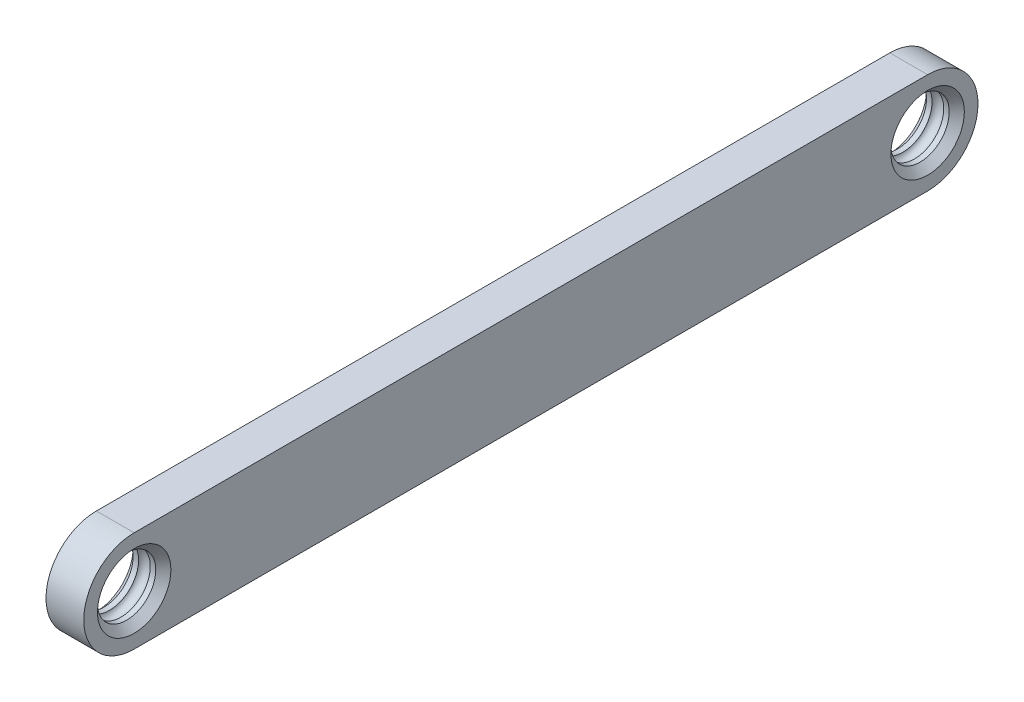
ISO-10303-21;
HEADER;
FILE_DESCRIPTION(('STEP AP214'),'2;1');
FILE_NAME('part.step','',(''),(''),'','','');
FILE_SCHEMA(('AUTOMOTIVE_DESIGN { 1 0 10303 214 1 1 1 1 }'));
ENDSEC;
DATA;
#1=APPLICATION_CONTEXT('core data for automotive mechanical design processes');
#2=APPLICATION_PROTOCOL_DEFINITION('international standard','automotive_design',2000,#1);
#3=PRODUCT_CONTEXT('',#1,'mechanical');
#4=PRODUCT('Part','Part','',(#3));
#5=PRODUCT_RELATED_PRODUCT_CATEGORY('part','',(#4));
#6=PRODUCT_DEFINITION_FORMATION('','',#4);
#7=PRODUCT_DEFINITION_CONTEXT('part definition',#1,'design');
#8=PRODUCT_DEFINITION('design','',#6,#7);
#9=PRODUCT_DEFINITION_SHAPE('','',#8);
#10=(LENGTH_UNIT() NAMED_UNIT(*) SI_UNIT(.MILLI.,.METRE.));
#11=(NAMED_UNIT(*) PLANE_ANGLE_UNIT() SI_UNIT($,.RADIAN.));
#12=(NAMED_UNIT(*) SI_UNIT($,.STERADIAN.) SOLID_ANGLE_UNIT());
#13=UNCERTAINTY_MEASURE_WITH_UNIT(LENGTH_MEASURE(1.E-05),#10,'distance_accuracy_value','');
#14=(GEOMETRIC_REPRESENTATION_CONTEXT(3) GLOBAL_UNCERTAINTY_ASSIGNED_CONTEXT((#13)) GLOBAL_UNIT_ASSIGNED_CONTEXT((#10,
#11,#12)) REPRESENTATION_CONTEXT('',''));
#15=CARTESIAN_POINT('',(0.,0.,0.));
#16=DIRECTION('',(0.,0.,1.));
#17=DIRECTION('',(1.,0.,0.));
#18=AXIS2_PLACEMENT_3D('',#15,#16,#17);
#19=CARTESIAN_POINT('',(4.7625,0.,-99.9999998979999));
#20=DIRECTION('',(-1.,0.,0.));
#21=DIRECTION('',(0.,0.,1.));
#22=AXIS2_PLACEMENT_3D('',#19,#20,#21);
#23=CYLINDRICAL_SURFACE('',#22,3.67499999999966);
#24=CARTESIAN_POINT('',(1.64637649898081,0.,-99.9999998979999));
#25=DIRECTION('',(1.,0.,0.));
#26=DIRECTION('',(0.,0.,-1.));
#27=AXIS2_PLACEMENT_3D('',#24,#25,#26);
#28=CIRCLE('',#27,3.67499999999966);
#29=CARTESIAN_POINT('',(1.64637649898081,0.,-96.3249998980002));
#30=VERTEX_POINT('',#29);
#31=EDGE_CURVE('E48',#30,#30,#28,.F.);
#32=CARTESIAN_POINT('',(0.952499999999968,0.,-99.9999998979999));
#33=DIRECTION('',(1.,0.,0.));
#34=DIRECTION('',(0.,0.,-1.));
#35=AXIS2_PLACEMENT_3D('',#32,#33,#34);
#36=CIRCLE('',#35,3.67499999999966);
#37=CARTESIAN_POINT('',(0.952499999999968,0.,-96.3249998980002));
#38=VERTEX_POINT('',#37);
#39=EDGE_CURVE('E11',#38,#38,#36,.F.);
#40=CARTESIAN_POINT('',(1.64637649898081,0.,-96.3249998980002));
#41=CARTESIAN_POINT('',(1.63914861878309,0.,-96.3249998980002));
#42=CARTESIAN_POINT('',(1.63192073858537,0.,-96.3249998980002));
#43=CARTESIAN_POINT('',(1.61746497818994,0.,-96.3249998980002));
#44=CARTESIAN_POINT('',(1.61023709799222,0.,-96.3249998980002));
#45=CARTESIAN_POINT('',(1.59578133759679,0.,-96.3249998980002));
#46=CARTESIAN_POINT('',(1.58855345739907,0.,-96.3249998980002));
#47=CARTESIAN_POINT('',(1.57409769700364,0.,-96.3249998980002));
#48=CARTESIAN_POINT('',(1.56686981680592,0.,-96.3249998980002));
#49=CARTESIAN_POINT('',(1.55241405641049,0.,-96.3249998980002));
#50=CARTESIAN_POINT('',(1.54518617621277,0.,-96.3249998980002));
#51=CARTESIAN_POINT('',(1.53073041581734,0.,-96.3249998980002));
#52=CARTESIAN_POINT('',(1.52350253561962,0.,-96.3249998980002));
#53=CARTESIAN_POINT('',(1.50904677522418,0.,-96.3249998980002));
#54=CARTESIAN_POINT('',(1.50181889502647,0.,-96.3249998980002));
#55=CARTESIAN_POINT('',(1.48736313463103,0.,-96.3249998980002));
#56=CARTESIAN_POINT('',(1.48013525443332,0.,-96.3249998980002));
#57=CARTESIAN_POINT('',(1.46567949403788,0.,-96.3249998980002));
#58=CARTESIAN_POINT('',(1.45845161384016,0.,-96.3249998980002));
#59=CARTESIAN_POINT('',(1.44399585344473,0.,-96.3249998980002));
#60=CARTESIAN_POINT('',(1.43676797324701,0.,-96.3249998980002));
#61=CARTESIAN_POINT('',(1.42231221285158,0.,-96.3249998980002));
#62=CARTESIAN_POINT('',(1.41508433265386,0.,-96.3249998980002));
#63=CARTESIAN_POINT('',(1.40062857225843,0.,-96.3249998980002));
#64=CARTESIAN_POINT('',(1.39340069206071,0.,-96.3249998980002));
#65=CARTESIAN_POINT('',(1.37894493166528,0.,-96.3249998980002));
#66=CARTESIAN_POINT('',(1.37171705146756,0.,-96.3249998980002));
#67=CARTESIAN_POINT('',(1.35726129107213,0.,-96.3249998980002));
#68=CARTESIAN_POINT('',(1.35003341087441,0.,-96.3249998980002));
#69=CARTESIAN_POINT('',(1.33557765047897,0.,-96.3249998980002));
#70=CARTESIAN_POINT('',(1.32834977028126,0.,-96.3249998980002));
#71=CARTESIAN_POINT('',(1.31389400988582,0.,-96.3249998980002));
#72=CARTESIAN_POINT('',(1.30666612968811,0.,-96.3249998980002));
#73=CARTESIAN_POINT('',(1.29221036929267,0.,-96.3249998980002));
#74=CARTESIAN_POINT('',(1.28498248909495,0.,-96.3249998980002));
#75=CARTESIAN_POINT('',(1.27052672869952,0.,-96.3249998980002));
#76=CARTESIAN_POINT('',(1.2632988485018,0.,-96.3249998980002));
#77=CARTESIAN_POINT('',(1.24884308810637,0.,-96.3249998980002));
#78=CARTESIAN_POINT('',(1.24161520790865,0.,-96.3249998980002));
#79=CARTESIAN_POINT('',(1.22715944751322,0.,-96.3249998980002));
#80=CARTESIAN_POINT('',(1.2199315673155,0.,-96.3249998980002));
#81=CARTESIAN_POINT('',(1.20547580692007,0.,-96.3249998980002));
#82=CARTESIAN_POINT('',(1.19824792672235,0.,-96.3249998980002));
#83=CARTESIAN_POINT('',(1.18379216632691,0.,-96.3249998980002));
#84=CARTESIAN_POINT('',(1.1765642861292,0.,-96.3249998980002));
#85=CARTESIAN_POINT('',(1.16210852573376,0.,-96.3249998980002));
#86=CARTESIAN_POINT('',(1.15488064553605,0.,-96.3249998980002));
#87=CARTESIAN_POINT('',(1.14042488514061,0.,-96.3249998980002));
#88=CARTESIAN_POINT('',(1.1331970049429,0.,-96.3249998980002));
#89=CARTESIAN_POINT('',(1.11874124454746,0.,-96.3249998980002));
#90=CARTESIAN_POINT('',(1.11151336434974,0.,-96.3249998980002));
#91=CARTESIAN_POINT('',(1.09705760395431,0.,-96.3249998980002));
#92=CARTESIAN_POINT('',(1.08982972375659,0.,-96.3249998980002));
#93=CARTESIAN_POINT('',(1.07537396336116,0.,-96.3249998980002));
#94=CARTESIAN_POINT('',(1.06814608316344,0.,-96.3249998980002));
#95=CARTESIAN_POINT('',(1.05369032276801,0.,-96.3249998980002));
#96=CARTESIAN_POINT('',(1.04646244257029,0.,-96.3249998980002));
#97=CARTESIAN_POINT('',(1.03200668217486,0.,-96.3249998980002));
#98=CARTESIAN_POINT('',(1.02477880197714,0.,-96.3249998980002));
#99=CARTESIAN_POINT('',(1.0103230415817,0.,-96.3249998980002));
#100=CARTESIAN_POINT('',(1.00309516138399,0.,-96.3249998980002));
#101=CARTESIAN_POINT('',(0.988639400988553,0.,-96.3249998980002));
#102=CARTESIAN_POINT('',(0.981411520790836,0.,-96.3249998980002));
#103=CARTESIAN_POINT('',(0.966955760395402,0.,-96.3249998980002));
#104=CARTESIAN_POINT('',(0.959727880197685,0.,-96.3249998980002));
#105=CARTESIAN_POINT('',(0.952499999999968,0.,-96.3249998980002));
#106=B_SPLINE_CURVE_WITH_KNOTS('',3,(#40,#41,#42,#43,#44,#45,#46,#47,#48,#49,#50,#51,#52,#53,
#54,#55,#56,#57,#58,#59,#60,#61,#62,#63,#64,#65,#66,#67,#68,#69,#70,#71,#72,#73,#74,#75,#76,#77,
#78,#79,#80,#81,#82,#83,#84,#85,#86,#87,#88,#89,#90,#91,#92,#93,#94,#95,#96,#97,#98,#99,#100,
#101,#102,#103,#104,#105),.UNSPECIFIED.,.F.,.F.,(4,2,2,2,2,2,2,2,2,2,2,2,2,2,2,2,2,2,2,2,2,2,2,
2,2,2,2,2,2,2,2,2,4),(0.,0.0216836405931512,0.0433672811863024,0.0650509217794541,
0.0867345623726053,0.108418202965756,0.130101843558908,0.151785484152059,0.173469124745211,
0.195152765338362,0.216836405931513,0.238520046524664,0.260203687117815,0.281887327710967,
0.303570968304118,0.325254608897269,0.346938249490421,0.368621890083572,0.390305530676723,
0.411989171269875,0.433672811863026,0.455356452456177,0.477040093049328,0.49872373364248,
0.520407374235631,0.542091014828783,0.563774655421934,0.585458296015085,0.607141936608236,
0.628825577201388,0.650509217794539,0.67219285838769,0.693876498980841),.UNSPECIFIED.);
#107=EDGE_CURVE('BSEAM43',#30,#38,#106,.T.);
#108=ORIENTED_EDGE('',*,*,#31,.F.);
#109=ORIENTED_EDGE('',*,*,#39,.T.);
#110=ORIENTED_EDGE('',*,*,#107,.T.);
#111=ORIENTED_EDGE('',*,*,#107,.F.);
#112=EDGE_LOOP('',(#108,#110,#109,#111));
#113=FACE_BOUND('',#112,.T.);
#114=ADVANCED_FACE('F43',(#113),#23,.F.);
#115=CARTESIAN_POINT('',(4.7625,0.,0.));
#116=DIRECTION('',(-1.,0.,0.));
#117=DIRECTION('',(0.,0.,1.));
#118=AXIS2_PLACEMENT_3D('',#115,#116,#117);
#119=CYLINDRICAL_SURFACE('',#118,3.675);
#120=CARTESIAN_POINT('',(1.64637649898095,0.,0.));
#121=DIRECTION('',(1.,0.,0.));
#122=DIRECTION('',(0.,0.,-1.));
#123=AXIS2_PLACEMENT_3D('',#120,#121,#122);
#124=CIRCLE('',#123,3.675);
#125=CARTESIAN_POINT('',(1.64637649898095,0.,3.675));
#126=VERTEX_POINT('',#125);
#127=EDGE_CURVE('E116',#126,#126,#124,.F.);
#128=CARTESIAN_POINT('',(0.952499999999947,0.,0.));
#129=DIRECTION('',(1.,0.,0.));
#130=DIRECTION('',(0.,0.,-1.));
#131=AXIS2_PLACEMENT_3D('',#128,#129,#130);
#132=CIRCLE('',#131,3.675);
#133=CARTESIAN_POINT('',(0.952499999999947,0.,3.675));
#134=VERTEX_POINT('',#133);
#135=EDGE_CURVE('E133',#134,#134,#132,.F.);
#136=CARTESIAN_POINT('',(1.64637649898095,0.,3.675));
#137=CARTESIAN_POINT('',(1.63914861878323,0.,3.675));
#138=CARTESIAN_POINT('',(1.63192073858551,0.,3.675));
#139=CARTESIAN_POINT('',(1.61746497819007,0.,3.675));
#140=CARTESIAN_POINT('',(1.61023709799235,0.,3.675));
#141=CARTESIAN_POINT('',(1.59578133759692,0.,3.675));
#142=CARTESIAN_POINT('',(1.5885534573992,0.,3.675));
#143=CARTESIAN_POINT('',(1.57409769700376,0.,3.675));
#144=CARTESIAN_POINT('',(1.56686981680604,0.,3.675));
#145=CARTESIAN_POINT('',(1.5524140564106,0.,3.675));
#146=CARTESIAN_POINT('',(1.54518617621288,0.,3.675));
#147=CARTESIAN_POINT('',(1.53073041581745,0.,3.675));
#148=CARTESIAN_POINT('',(1.52350253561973,0.,3.675));
#149=CARTESIAN_POINT('',(1.50904677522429,0.,3.675));
#150=CARTESIAN_POINT('',(1.50181889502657,0.,3.675));
#151=CARTESIAN_POINT('',(1.48736313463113,0.,3.675));
#152=CARTESIAN_POINT('',(1.48013525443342,0.,3.675));
#153=CARTESIAN_POINT('',(1.46567949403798,0.,3.675));
#154=CARTESIAN_POINT('',(1.45845161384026,0.,3.675));
#155=CARTESIAN_POINT('',(1.44399585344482,0.,3.675));
#156=CARTESIAN_POINT('',(1.4367679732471,0.,3.675));
#157=CARTESIAN_POINT('',(1.42231221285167,0.,3.675));
#158=CARTESIAN_POINT('',(1.41508433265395,0.,3.675));
#159=CARTESIAN_POINT('',(1.40062857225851,0.,3.675));
#160=CARTESIAN_POINT('',(1.39340069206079,0.,3.675));
#161=CARTESIAN_POINT('',(1.37894493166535,0.,3.675));
#162=CARTESIAN_POINT('',(1.37171705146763,0.,3.675));
#163=CARTESIAN_POINT('',(1.3572612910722,0.,3.675));
#164=CARTESIAN_POINT('',(1.35003341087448,0.,3.675));
#165=CARTESIAN_POINT('',(1.33557765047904,0.,3.675));
#166=CARTESIAN_POINT('',(1.32834977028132,0.,3.675));
#167=CARTESIAN_POINT('',(1.31389400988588,0.,3.675));
#168=CARTESIAN_POINT('',(1.30666612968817,0.,3.675));
#169=CARTESIAN_POINT('',(1.29221036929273,0.,3.675));
#170=CARTESIAN_POINT('',(1.28498248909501,0.,3.675));
#171=CARTESIAN_POINT('',(1.27052672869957,0.,3.675));
#172=CARTESIAN_POINT('',(1.26329884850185,0.,3.675));
#173=CARTESIAN_POINT('',(1.24884308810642,0.,3.675));
#174=CARTESIAN_POINT('',(1.2416152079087,0.,3.675));
#175=CARTESIAN_POINT('',(1.22715944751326,0.,3.675));
#176=CARTESIAN_POINT('',(1.21993156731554,0.,3.675));
#177=CARTESIAN_POINT('',(1.2054758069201,0.,3.675));
#178=CARTESIAN_POINT('',(1.19824792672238,0.,3.675));
#179=CARTESIAN_POINT('',(1.18379216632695,0.,3.675));
#180=CARTESIAN_POINT('',(1.17656428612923,0.,3.675));
#181=CARTESIAN_POINT('',(1.16210852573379,0.,3.675));
#182=CARTESIAN_POINT('',(1.15488064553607,0.,3.675));
#183=CARTESIAN_POINT('',(1.14042488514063,0.,3.675));
#184=CARTESIAN_POINT('',(1.13319700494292,0.,3.675));
#185=CARTESIAN_POINT('',(1.11874124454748,0.,3.675));
#186=CARTESIAN_POINT('',(1.11151336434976,0.,3.675));
#187=CARTESIAN_POINT('',(1.09705760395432,0.,3.675));
#188=CARTESIAN_POINT('',(1.0898297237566,0.,3.675));
#189=CARTESIAN_POINT('',(1.07537396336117,0.,3.675));
#190=CARTESIAN_POINT('',(1.06814608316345,0.,3.675));
#191=CARTESIAN_POINT('',(1.05369032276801,0.,3.675));
#192=CARTESIAN_POINT('',(1.04646244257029,0.,3.675));
#193=CARTESIAN_POINT('',(1.03200668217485,0.,3.675));
#194=CARTESIAN_POINT('',(1.02477880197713,0.,3.675));
#195=CARTESIAN_POINT('',(1.0103230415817,0.,3.675));
#196=CARTESIAN_POINT('',(1.00309516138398,0.,3.675));
#197=CARTESIAN_POINT('',(0.988639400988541,0.,3.675));
#198=CARTESIAN_POINT('',(0.981411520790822,0.,3.675));
#199=CARTESIAN_POINT('',(0.966955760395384,0.,3.675));
#200=CARTESIAN_POINT('',(0.959727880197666,0.,3.675));
#201=CARTESIAN_POINT('',(0.952499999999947,0.,3.675));
#202=B_SPLINE_CURVE_WITH_KNOTS('',3,(#136,#137,#138,#139,#140,#141,#142,#143,#144,#145,#146,
#147,#148,#149,#150,#151,#152,#153,#154,#155,#156,#157,#158,#159,#160,#161,#162,#163,#164,#165,
#166,#167,#168,#169,#170,#171,#172,#173,#174,#175,#176,#177,#178,#179,#180,#181,#182,#183,#184,
#185,#186,#187,#188,#189,#190,#191,#192,#193,#194,#195,#196,#197,#198,#199,#200,#201),
.UNSPECIFIED.,.F.,.F.,(4,2,2,2,2,2,2,2,2,2,2,2,2,2,2,2,2,2,2,2,2,2,2,2,2,2,2,2,2,2,2,2,4),(0.,
0.0216836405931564,0.0433672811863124,0.0650509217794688,0.0867345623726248,0.108418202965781,
0.130101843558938,0.151785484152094,0.17346912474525,0.195152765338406,0.216836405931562,
0.238520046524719,0.260203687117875,0.281887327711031,0.303570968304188,0.325254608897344,
0.3469382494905,0.368621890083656,0.390305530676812,0.411989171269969,0.433672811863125,
0.455356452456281,0.477040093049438,0.498723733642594,0.52040737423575,0.542091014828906,
0.563774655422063,0.585458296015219,0.607141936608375,0.628825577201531,0.650509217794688,
0.672192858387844,0.693876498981),.UNSPECIFIED.);
#203=EDGE_CURVE('BSEAM159',#126,#134,#202,.T.);
#204=ORIENTED_EDGE('',*,*,#127,.F.);
#205=ORIENTED_EDGE('',*,*,#135,.T.);
#206=ORIENTED_EDGE('',*,*,#203,.T.);
#207=ORIENTED_EDGE('',*,*,#203,.F.);
#208=EDGE_LOOP('',(#204,#206,#205,#207));
#209=FACE_BOUND('',#208,.T.);
#210=ADVANCED_FACE('F159',(#209),#119,.F.);
#211=CARTESIAN_POINT('',(4.7625,-6.35,0.));
#212=DIRECTION('',(0.,1.,0.));
#213=DIRECTION('',(0.,0.,1.));
#214=AXIS2_PLACEMENT_3D('',#211,#212,#213);
#215=PLANE('',#214);
#216=DIRECTION('',(0.,0.,-1.));
#217=VECTOR('',#216,1.);
#218=CARTESIAN_POINT('',(0.,-6.35,0.));
#219=LINE('',#218,#217);
#220=CARTESIAN_POINT('',(0.,-6.35,0.));
#221=VERTEX_POINT('',#220);
#222=CARTESIAN_POINT('',(0.,-6.35,-99.9999998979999));
#223=VERTEX_POINT('',#222);
#224=EDGE_CURVE('E113',#221,#223,#219,.T.);
#225=ORIENTED_EDGE('',*,*,#224,.T.);
#226=DIRECTION('',(-1.,0.,0.));
#227=VECTOR('',#226,1.);
#228=CARTESIAN_POINT('',(4.7625,-6.35,-99.9999998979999));
#229=LINE('',#228,#227);
#230=CARTESIAN_POINT('',(4.7625,-6.35,-99.9999998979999));
#231=VERTEX_POINT('',#230);
#232=EDGE_CURVE('E105',#231,#223,#229,.T.);
#233=ORIENTED_EDGE('',*,*,#232,.F.);
#234=DIRECTION('',(0.,0.,-1.));
#235=VECTOR('',#234,1.);
#236=CARTESIAN_POINT('',(4.7625,-6.35,0.));
#237=LINE('',#236,#235);
#238=CARTESIAN_POINT('',(4.7625,-6.35,0.));
#239=VERTEX_POINT('',#238);
#240=EDGE_CURVE('E95',#239,#231,#237,.T.);
#241=ORIENTED_EDGE('',*,*,#240,.F.);
#242=DIRECTION('',(-1.,0.,0.));
#243=VECTOR('',#242,1.);
#244=CARTESIAN_POINT('',(4.7625,-6.35,0.));
#245=LINE('',#244,#243);
#246=EDGE_CURVE('E109',#239,#221,#245,.T.);
#247=ORIENTED_EDGE('',*,*,#246,.T.);
#248=EDGE_LOOP('',(#225,#233,#241,#247));
#249=FACE_BOUND('',#248,.T.);
#250=ADVANCED_FACE('F178',(#249),#215,.F.);
#251=CARTESIAN_POINT('',(4.7625,0.,-99.9999998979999));
#252=DIRECTION('',(-1.,0.,0.));
#253=DIRECTION('',(0.,0.,1.));
#254=AXIS2_PLACEMENT_3D('',#251,#252,#253);
#255=CYLINDRICAL_SURFACE('',#254,6.35);
#256=CARTESIAN_POINT('',(0.,0.,-99.9999998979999));
#257=DIRECTION('',(1.,0.,0.));
#258=DIRECTION('',(0.,0.,-1.));
#259=AXIS2_PLACEMENT_3D('',#256,#257,#258);
#260=CIRCLE('',#259,6.35);
#261=CARTESIAN_POINT('',(0.,6.35,-99.9999998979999));
#262=VERTEX_POINT('',#261);
#263=EDGE_CURVE('E101',#223,#262,#260,.T.);
#264=ORIENTED_EDGE('',*,*,#263,.T.);
#265=DIRECTION('',(-1.,0.,0.));
#266=VECTOR('',#265,1.);
#267=CARTESIAN_POINT('',(4.7625,6.35,-99.9999998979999));
#268=LINE('',#267,#266);
#269=CARTESIAN_POINT('',(4.7625,6.35,-99.9999998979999));
#270=VERTEX_POINT('',#269);
#271=EDGE_CURVE('E99',#270,#262,#268,.T.);
#272=ORIENTED_EDGE('',*,*,#271,.F.);
#273=CARTESIAN_POINT('',(4.7625,0.,-99.9999998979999));
#274=DIRECTION('',(1.,0.,0.));
#275=DIRECTION('',(0.,0.,-1.));
#276=AXIS2_PLACEMENT_3D('',#273,#274,#275);
#277=CIRCLE('',#276,6.35);
#278=EDGE_CURVE('E90',#231,#270,#277,.T.);
#279=ORIENTED_EDGE('',*,*,#278,.F.);
#280=ORIENTED_EDGE('',*,*,#232,.T.);
#281=EDGE_LOOP('',(#264,#272,#279,#280));
#282=FACE_BOUND('',#281,.T.);
#283=ADVANCED_FACE('F100',(#282),#255,.T.);
#284=CARTESIAN_POINT('',(4.7625,6.35,0.));
#285=DIRECTION('',(0.,1.,0.));
#286=DIRECTION('',(0.,0.,1.));
#287=AXIS2_PLACEMENT_3D('',#284,#285,#286);
#288=PLANE('',#287);
#289=DIRECTION('',(0.,0.,-1.));
#290=VECTOR('',#289,1.);
#291=CARTESIAN_POINT('',(0.,6.35,0.));
#292=LINE('',#291,#290);
#293=CARTESIAN_POINT('',(0.,6.35,0.));
#294=VERTEX_POINT('',#293);
#295=EDGE_CURVE('E118',#294,#262,#292,.T.);
#296=ORIENTED_EDGE('',*,*,#295,.F.);
#297=DIRECTION('',(-1.,0.,0.));
#298=VECTOR('',#297,1.);
#299=CARTESIAN_POINT('',(4.7625,6.35,0.));
#300=LINE('',#299,#298);
#301=CARTESIAN_POINT('',(4.7625,6.35,0.));
#302=VERTEX_POINT('',#301);
#303=EDGE_CURVE('E79',#302,#294,#300,.T.);
#304=ORIENTED_EDGE('',*,*,#303,.F.);
#305=DIRECTION('',(0.,0.,-1.));
#306=VECTOR('',#305,1.);
#307=CARTESIAN_POINT('',(4.7625,6.35,0.));
#308=LINE('',#307,#306);
#309=EDGE_CURVE('E93',#302,#270,#308,.T.);
#310=ORIENTED_EDGE('',*,*,#309,.T.);
#311=ORIENTED_EDGE('',*,*,#271,.T.);
#312=EDGE_LOOP('',(#296,#304,#310,#311));
#313=FACE_BOUND('',#312,.T.);
#314=ADVANCED_FACE('F107',(#313),#288,.T.);
#315=CARTESIAN_POINT('',(3.11612350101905,0.,0.));
#316=DIRECTION('',(-1.,0.,0.));
#317=DIRECTION('',(0.,0.,1.));
#318=AXIS2_PLACEMENT_3D('',#315,#316,#317);
#319=CIRCLE('',#318,3.675);
#320=CARTESIAN_POINT('',(3.11612350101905,0.,3.675));
#321=VERTEX_POINT('',#320);
#322=EDGE_CURVE('E144',#321,#321,#319,.F.);
#323=CARTESIAN_POINT('',(3.80999999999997,0.,0.));
#324=DIRECTION('',(1.,0.,0.));
#325=DIRECTION('',(0.,0.,-1.));
#326=AXIS2_PLACEMENT_3D('',#323,#324,#325);
#327=CIRCLE('',#326,3.675);
#328=CARTESIAN_POINT('',(3.80999999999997,0.,3.675));
#329=VERTEX_POINT('',#328);
#330=EDGE_CURVE('E130',#329,#329,#327,.T.);
#331=CARTESIAN_POINT('',(3.11612350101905,0.,3.675));
#332=CARTESIAN_POINT('',(3.12335138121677,0.,3.675));
#333=CARTESIAN_POINT('',(3.13057926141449,0.,3.675));
#334=CARTESIAN_POINT('',(3.14503502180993,0.,3.675));
#335=CARTESIAN_POINT('',(3.15226290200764,0.,3.675));
#336=CARTESIAN_POINT('',(3.16671866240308,0.,3.675));
#337=CARTESIAN_POINT('',(3.1739465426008,0.,3.675));
#338=CARTESIAN_POINT('',(3.18840230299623,0.,3.675));
#339=CARTESIAN_POINT('',(3.19563018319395,0.,3.675));
#340=CARTESIAN_POINT('',(3.21008594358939,0.,3.675));
#341=CARTESIAN_POINT('',(3.2173138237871,0.,3.675));
#342=CARTESIAN_POINT('',(3.23176958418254,0.,3.675));
#343=CARTESIAN_POINT('',(3.23899746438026,0.,3.675));
#344=CARTESIAN_POINT('',(3.25345322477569,0.,3.675));
#345=CARTESIAN_POINT('',(3.26068110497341,0.,3.675));
#346=CARTESIAN_POINT('',(3.27513686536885,0.,3.675));
#347=CARTESIAN_POINT('',(3.28236474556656,0.,3.675));
#348=CARTESIAN_POINT('',(3.296820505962,0.,3.675));
#349=CARTESIAN_POINT('',(3.30404838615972,0.,3.675));
#350=CARTESIAN_POINT('',(3.31850414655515,0.,3.675));
#351=CARTESIAN_POINT('',(3.32573202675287,0.,3.675));
#352=CARTESIAN_POINT('',(3.34018778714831,0.,3.675));
#353=CARTESIAN_POINT('',(3.34741566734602,0.,3.675));
#354=CARTESIAN_POINT('',(3.36187142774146,0.,3.675));
#355=CARTESIAN_POINT('',(3.36909930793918,0.,3.675));
#356=CARTESIAN_POINT('',(3.38355506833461,0.,3.675));
#357=CARTESIAN_POINT('',(3.39078294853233,0.,3.675));
#358=CARTESIAN_POINT('',(3.40523870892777,0.,3.675));
#359=CARTESIAN_POINT('',(3.41246658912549,0.,3.675));
#360=CARTESIAN_POINT('',(3.42692234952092,0.,3.675));
#361=CARTESIAN_POINT('',(3.43415022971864,0.,3.675));
#362=CARTESIAN_POINT('',(3.44860599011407,0.,3.675));
#363=CARTESIAN_POINT('',(3.45583387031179,0.,3.675));
#364=CARTESIAN_POINT('',(3.47028963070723,0.,3.675));
#365=CARTESIAN_POINT('',(3.47751751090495,0.,3.675));
#366=CARTESIAN_POINT('',(3.49197327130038,0.,3.675));
#367=CARTESIAN_POINT('',(3.4992011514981,0.,3.675));
#368=CARTESIAN_POINT('',(3.51365691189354,0.,3.675));
#369=CARTESIAN_POINT('',(3.52088479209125,0.,3.675));
#370=CARTESIAN_POINT('',(3.53534055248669,0.,3.675));
#371=CARTESIAN_POINT('',(3.54256843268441,0.,3.675));
#372=CARTESIAN_POINT('',(3.55702419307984,0.,3.675));
#373=CARTESIAN_POINT('',(3.56425207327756,0.,3.675));
#374=CARTESIAN_POINT('',(3.578707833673,0.,3.675));
#375=CARTESIAN_POINT('',(3.58593571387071,0.,3.675));
#376=CARTESIAN_POINT('',(3.60039147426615,0.,3.675));
#377=CARTESIAN_POINT('',(3.60761935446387,0.,3.675));
#378=CARTESIAN_POINT('',(3.6220751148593,0.,3.675));
#379=CARTESIAN_POINT('',(3.62930299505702,0.,3.675));
#380=CARTESIAN_POINT('',(3.64375875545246,0.,3.675));
#381=CARTESIAN_POINT('',(3.65098663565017,0.,3.675));
#382=CARTESIAN_POINT('',(3.66544239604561,0.,3.675));
#383=CARTESIAN_POINT('',(3.67267027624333,0.,3.675));
#384=CARTESIAN_POINT('',(3.68712603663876,0.,3.675));
#385=CARTESIAN_POINT('',(3.69435391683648,0.,3.675));
#386=CARTESIAN_POINT('',(3.70880967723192,0.,3.675));
#387=CARTESIAN_POINT('',(3.71603755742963,0.,3.675));
#388=CARTESIAN_POINT('',(3.73049331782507,0.,3.675));
#389=CARTESIAN_POINT('',(3.73772119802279,0.,3.675));
#390=CARTESIAN_POINT('',(3.75217695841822,0.,3.675));
#391=CARTESIAN_POINT('',(3.75940483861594,0.,3.675));
#392=CARTESIAN_POINT('',(3.77386059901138,0.,3.675));
#393=CARTESIAN_POINT('',(3.7810884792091,0.,3.675));
#394=CARTESIAN_POINT('',(3.79554423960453,0.,3.675));
#395=CARTESIAN_POINT('',(3.80277211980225,0.,3.675));
#396=CARTESIAN_POINT('',(3.80999999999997,0.,3.675));
#397=B_SPLINE_CURVE_WITH_KNOTS('',3,(#331,#332,#333,#334,#335,#336,#337,#338,#339,#340,#341,
#342,#343,#344,#345,#346,#347,#348,#349,#350,#351,#352,#353,#354,#355,#356,#357,#358,#359,#360,
#361,#362,#363,#364,#365,#366,#367,#368,#369,#370,#371,#372,#373,#374,#375,#376,#377,#378,#379,
#380,#381,#382,#383,#384,#385,#386,#387,#388,#389,#390,#391,#392,#393,#394,#395,#396),
.UNSPECIFIED.,.F.,.F.,(4,2,2,2,2,2,2,2,2,2,2,2,2,2,2,2,2,2,2,2,2,2,2,2,2,2,2,2,2,2,2,2,4),(0.,
0.0216836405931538,0.0433672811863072,0.0650509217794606,0.0867345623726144,0.108418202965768,
0.130101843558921,0.151785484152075,0.173469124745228,0.195152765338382,0.216836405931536,
0.238520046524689,0.260203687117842,0.281887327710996,0.303570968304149,0.325254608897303,
0.346938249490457,0.36862189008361,0.390305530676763,0.411989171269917,0.433672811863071,
0.455356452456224,0.477040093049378,0.498723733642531,0.520407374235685,0.542091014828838,
0.563774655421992,0.585458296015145,0.607141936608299,0.628825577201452,0.650509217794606,
0.67219285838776,0.693876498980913),.UNSPECIFIED.);
#398=EDGE_CURVE('BSEAM189',#321,#329,#397,.T.);
#399=ORIENTED_EDGE('',*,*,#322,.F.);
#400=ORIENTED_EDGE('',*,*,#330,.T.);
#401=ORIENTED_EDGE('',*,*,#398,.T.);
#402=ORIENTED_EDGE('',*,*,#398,.F.);
#403=EDGE_LOOP('',(#399,#401,#400,#402));
#404=FACE_BOUND('',#403,.T.);
#405=ADVANCED_FACE('F189',(#404),#119,.F.);
#406=CARTESIAN_POINT('',(3.11612350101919,0.,-99.9999998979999));
#407=DIRECTION('',(-1.,0.,0.));
#408=DIRECTION('',(0.,0.,1.));
#409=AXIS2_PLACEMENT_3D('',#406,#407,#408);
#410=CIRCLE('',#409,3.67499999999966);
#411=CARTESIAN_POINT('',(3.11612350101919,0.,-96.3249998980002));
#412=VERTEX_POINT('',#411);
#413=EDGE_CURVE('E148',#412,#412,#410,.F.);
#414=CARTESIAN_POINT('',(3.80999999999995,0.,-99.9999998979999));
#415=DIRECTION('',(1.,0.,0.));
#416=DIRECTION('',(0.,0.,-1.));
#417=AXIS2_PLACEMENT_3D('',#414,#415,#416);
#418=CIRCLE('',#417,3.67499999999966);
#419=CARTESIAN_POINT('',(3.80999999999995,0.,-96.3249998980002));
#420=VERTEX_POINT('',#419);
#421=EDGE_CURVE('E54',#420,#420,#418,.T.);
#422=CARTESIAN_POINT('',(3.11612350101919,0.,-96.3249998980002));
#423=CARTESIAN_POINT('',(3.12335138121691,0.,-96.3249998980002));
#424=CARTESIAN_POINT('',(3.13057926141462,0.,-96.3249998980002));
#425=CARTESIAN_POINT('',(3.14503502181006,0.,-96.3249998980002));
#426=CARTESIAN_POINT('',(3.15226290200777,0.,-96.3249998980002));
#427=CARTESIAN_POINT('',(3.16671866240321,0.,-96.3249998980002));
#428=CARTESIAN_POINT('',(3.17394654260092,0.,-96.3249998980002));
#429=CARTESIAN_POINT('',(3.18840230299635,0.,-96.3249998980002));
#430=CARTESIAN_POINT('',(3.19563018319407,0.,-96.3249998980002));
#431=CARTESIAN_POINT('',(3.2100859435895,0.,-96.3249998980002));
#432=CARTESIAN_POINT('',(3.21731382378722,0.,-96.3249998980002));
#433=CARTESIAN_POINT('',(3.23176958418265,0.,-96.3249998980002));
#434=CARTESIAN_POINT('',(3.23899746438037,0.,-96.3249998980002));
#435=CARTESIAN_POINT('',(3.2534532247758,0.,-96.3249998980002));
#436=CARTESIAN_POINT('',(3.26068110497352,0.,-96.3249998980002));
#437=CARTESIAN_POINT('',(3.27513686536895,0.,-96.3249998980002));
#438=CARTESIAN_POINT('',(3.28236474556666,0.,-96.3249998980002));
#439=CARTESIAN_POINT('',(3.2968205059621,0.,-96.3249998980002));
#440=CARTESIAN_POINT('',(3.30404838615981,0.,-96.3249998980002));
#441=CARTESIAN_POINT('',(3.31850414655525,0.,-96.3249998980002));
#442=CARTESIAN_POINT('',(3.32573202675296,0.,-96.3249998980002));
#443=CARTESIAN_POINT('',(3.34018778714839,0.,-96.3249998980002));
#444=CARTESIAN_POINT('',(3.34741566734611,0.,-96.3249998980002));
#445=CARTESIAN_POINT('',(3.36187142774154,0.,-96.3249998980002));
#446=CARTESIAN_POINT('',(3.36909930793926,0.,-96.3249998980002));
#447=CARTESIAN_POINT('',(3.38355506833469,0.,-96.3249998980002));
#448=CARTESIAN_POINT('',(3.39078294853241,0.,-96.3249998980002));
#449=CARTESIAN_POINT('',(3.40523870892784,0.,-96.3249998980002));
#450=CARTESIAN_POINT('',(3.41246658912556,0.,-96.3249998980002));
#451=CARTESIAN_POINT('',(3.42692234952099,0.,-96.3249998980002));
#452=CARTESIAN_POINT('',(3.4341502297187,0.,-96.3249998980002));
#453=CARTESIAN_POINT('',(3.44860599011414,0.,-96.3249998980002));
#454=CARTESIAN_POINT('',(3.45583387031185,0.,-96.3249998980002));
#455=CARTESIAN_POINT('',(3.47028963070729,0.,-96.3249998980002));
#456=CARTESIAN_POINT('',(3.477517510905,0.,-96.3249998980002));
#457=CARTESIAN_POINT('',(3.49197327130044,0.,-96.3249998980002));
#458=CARTESIAN_POINT('',(3.49920115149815,0.,-96.3249998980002));
#459=CARTESIAN_POINT('',(3.51365691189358,0.,-96.3249998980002));
#460=CARTESIAN_POINT('',(3.5208847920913,0.,-96.3249998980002));
#461=CARTESIAN_POINT('',(3.53534055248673,0.,-96.3249998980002));
#462=CARTESIAN_POINT('',(3.54256843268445,0.,-96.3249998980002));
#463=CARTESIAN_POINT('',(3.55702419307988,0.,-96.3249998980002));
#464=CARTESIAN_POINT('',(3.5642520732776,0.,-96.3249998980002));
#465=CARTESIAN_POINT('',(3.57870783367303,0.,-96.3249998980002));
#466=CARTESIAN_POINT('',(3.58593571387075,0.,-96.3249998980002));
#467=CARTESIAN_POINT('',(3.60039147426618,0.,-96.3249998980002));
#468=CARTESIAN_POINT('',(3.60761935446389,0.,-96.3249998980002));
#469=CARTESIAN_POINT('',(3.62207511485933,0.,-96.3249998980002));
#470=CARTESIAN_POINT('',(3.62930299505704,0.,-96.3249998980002));
#471=CARTESIAN_POINT('',(3.64375875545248,0.,-96.3249998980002));
#472=CARTESIAN_POINT('',(3.65098663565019,0.,-96.3249998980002));
#473=CARTESIAN_POINT('',(3.66544239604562,0.,-96.3249998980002));
#474=CARTESIAN_POINT('',(3.67267027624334,0.,-96.3249998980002));
#475=CARTESIAN_POINT('',(3.68712603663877,0.,-96.3249998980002));
#476=CARTESIAN_POINT('',(3.69435391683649,0.,-96.3249998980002));
#477=CARTESIAN_POINT('',(3.70880967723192,0.,-96.3249998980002));
#478=CARTESIAN_POINT('',(3.71603755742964,0.,-96.3249998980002));
#479=CARTESIAN_POINT('',(3.73049331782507,0.,-96.3249998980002));
#480=CARTESIAN_POINT('',(3.73772119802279,0.,-96.3249998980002));
#481=CARTESIAN_POINT('',(3.75217695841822,0.,-96.3249998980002));
#482=CARTESIAN_POINT('',(3.75940483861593,0.,-96.3249998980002));
#483=CARTESIAN_POINT('',(3.77386059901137,0.,-96.3249998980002));
#484=CARTESIAN_POINT('',(3.78108847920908,0.,-96.3249998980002));
#485=CARTESIAN_POINT('',(3.79554423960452,0.,-96.3249998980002));
#486=CARTESIAN_POINT('',(3.80277211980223,0.,-96.3249998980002));
#487=CARTESIAN_POINT('',(3.80999999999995,0.,-96.3249998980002));
#488=B_SPLINE_CURVE_WITH_KNOTS('',3,(#422,#423,#424,#425,#426,#427,#428,#429,#430,#431,#432,
#433,#434,#435,#436,#437,#438,#439,#440,#441,#442,#443,#444,#445,#446,#447,#448,#449,#450,#451,
#452,#453,#454,#455,#456,#457,#458,#459,#460,#461,#462,#463,#464,#465,#466,#467,#468,#469,#470,
#471,#472,#473,#474,#475,#476,#477,#478,#479,#480,#481,#482,#483,#484,#485,#486,#487),
.UNSPECIFIED.,.F.,.F.,(4,2,2,2,2,2,2,2,2,2,2,2,2,2,2,2,2,2,2,2,2,2,2,2,2,2,2,2,2,2,2,2,4),(0.,
0.0216836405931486,0.0433672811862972,0.0650509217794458,0.0867345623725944,0.108418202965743,
0.130101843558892,0.15178548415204,0.173469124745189,0.195152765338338,0.216836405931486,
0.238520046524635,0.260203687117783,0.281887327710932,0.303570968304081,0.32525460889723,
0.346938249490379,0.368621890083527,0.390305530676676,0.411989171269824,0.433672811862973,
0.455356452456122,0.47704009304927,0.498723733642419,0.520407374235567,0.542091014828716,
0.563774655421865,0.585458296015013,0.607141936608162,0.628825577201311,0.650509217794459,
0.672192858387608,0.693876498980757),.UNSPECIFIED.);
#489=EDGE_CURVE('BSEAM161',#412,#420,#488,.T.);
#490=ORIENTED_EDGE('',*,*,#413,.F.);
#491=ORIENTED_EDGE('',*,*,#421,.T.);
#492=ORIENTED_EDGE('',*,*,#489,.T.);
#493=ORIENTED_EDGE('',*,*,#489,.F.);
#494=EDGE_LOOP('',(#490,#492,#491,#493));
#495=FACE_BOUND('',#494,.T.);
#496=ADVANCED_FACE('F161',(#495),#23,.F.);
#497=CARTESIAN_POINT('',(4.7625,0.,0.));
#498=DIRECTION('',(-1.,0.,0.));
#499=DIRECTION('',(0.,0.,1.));
#500=AXIS2_PLACEMENT_3D('',#497,#498,#499);
#501=CYLINDRICAL_SURFACE('',#500,6.35);
#502=CARTESIAN_POINT('',(0.,0.,0.));
#503=DIRECTION('',(1.,0.,0.));
#504=DIRECTION('',(0.,0.,-1.));
#505=AXIS2_PLACEMENT_3D('',#502,#503,#504);
#506=CIRCLE('',#505,6.35);
#507=EDGE_CURVE('E82',#294,#221,#506,.T.);
#508=ORIENTED_EDGE('',*,*,#507,.T.);
#509=ORIENTED_EDGE('',*,*,#246,.F.);
#510=CARTESIAN_POINT('',(4.7625,0.,0.));
#511=DIRECTION('',(1.,0.,0.));
#512=DIRECTION('',(0.,0.,-1.));
#513=AXIS2_PLACEMENT_3D('',#510,#511,#512);
#514=CIRCLE('',#513,6.35);
#515=EDGE_CURVE('E63',#302,#239,#514,.T.);
#516=ORIENTED_EDGE('',*,*,#515,.F.);
#517=ORIENTED_EDGE('',*,*,#303,.T.);
#518=EDGE_LOOP('',(#508,#509,#516,#517));
#519=FACE_BOUND('',#518,.T.);
#520=ADVANCED_FACE('F179',(#519),#501,.T.);
#521=CARTESIAN_POINT('',(4.7625,0.,0.));
#522=DIRECTION('',(1.,0.,0.));
#523=DIRECTION('',(0.,0.,-1.));
#524=AXIS2_PLACEMENT_3D('',#521,#522,#523);
#525=PLANE('',#524);
#526=CARTESIAN_POINT('',(4.7625,0.,0.));
#527=DIRECTION('',(1.,0.,0.));
#528=DIRECTION('',(0.,0.,-1.));
#529=AXIS2_PLACEMENT_3D('',#526,#527,#528);
#530=CIRCLE('',#529,4.62750000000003);
#531=CARTESIAN_POINT('',(4.7625,0.,-4.62750000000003));
#532=VERTEX_POINT('',#531);
#533=EDGE_CURVE('E139',#532,#532,#530,.F.);
#534=ORIENTED_EDGE('',*,*,#533,.T.);
#535=EDGE_LOOP('',(#534));
#536=FACE_BOUND('',#535,.T.);
#537=CARTESIAN_POINT('',(4.7625,0.,-99.9999998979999));
#538=DIRECTION('',(1.,0.,0.));
#539=DIRECTION('',(0.,0.,-1.));
#540=AXIS2_PLACEMENT_3D('',#537,#538,#539);
#541=CIRCLE('',#540,4.62749999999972);
#542=CARTESIAN_POINT('',(4.7625,0.,-104.627499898));
#543=VERTEX_POINT('',#542);
#544=EDGE_CURVE('E136',#543,#543,#541,.F.);
#545=ORIENTED_EDGE('',*,*,#544,.T.);
#546=EDGE_LOOP('',(#545));
#547=FACE_BOUND('',#546,.T.);
#548=ORIENTED_EDGE('',*,*,#240,.T.);
#549=ORIENTED_EDGE('',*,*,#278,.T.);
#550=ORIENTED_EDGE('',*,*,#309,.F.);
#551=ORIENTED_EDGE('',*,*,#515,.T.);
#552=EDGE_LOOP('',(#548,#549,#550,#551));
#553=FACE_BOUND('',#552,.T.);
#554=ADVANCED_FACE('F91',(#536,#547,#553),#525,.T.);
#555=CARTESIAN_POINT('',(0.,0.,0.));
#556=DIRECTION('',(1.,0.,0.));
#557=DIRECTION('',(0.,0.,-1.));
#558=AXIS2_PLACEMENT_3D('',#555,#556,#557);
#559=PLANE('',#558);
#560=CARTESIAN_POINT('',(0.,0.,0.));
#561=DIRECTION('',(1.,0.,0.));
#562=DIRECTION('',(0.,0.,-1.));
#563=AXIS2_PLACEMENT_3D('',#560,#561,#562);
#564=CIRCLE('',#563,4.62749999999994);
#565=CARTESIAN_POINT('',(0.,0.,4.62749999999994));
#566=VERTEX_POINT('',#565);
#567=EDGE_CURVE('E127',#566,#566,#564,.T.);
#568=ORIENTED_EDGE('',*,*,#567,.T.);
#569=EDGE_LOOP('',(#568));
#570=FACE_BOUND('',#569,.T.);
#571=CARTESIAN_POINT('',(0.,0.,-99.9999998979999));
#572=DIRECTION('',(1.,0.,0.));
#573=DIRECTION('',(0.,0.,-1.));
#574=AXIS2_PLACEMENT_3D('',#571,#572,#573);
#575=CIRCLE('',#574,4.62749999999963);
#576=CARTESIAN_POINT('',(0.,0.,-95.3724998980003));
#577=VERTEX_POINT('',#576);
#578=EDGE_CURVE('E124',#577,#577,#575,.T.);
#579=ORIENTED_EDGE('',*,*,#578,.T.);
#580=EDGE_LOOP('',(#579));
#581=FACE_BOUND('',#580,.T.);
#582=ORIENTED_EDGE('',*,*,#224,.F.);
#583=ORIENTED_EDGE('',*,*,#507,.F.);
#584=ORIENTED_EDGE('',*,*,#295,.T.);
#585=ORIENTED_EDGE('',*,*,#263,.F.);
#586=EDGE_LOOP('',(#582,#583,#584,#585));
#587=FACE_BOUND('',#586,.T.);
#588=ADVANCED_FACE('F170',(#570,#581,#587),#559,.F.);
#589=CARTESIAN_POINT('',(0.,0.,0.));
#590=DIRECTION('',(-1.,0.,0.));
#591=DIRECTION('',(0.,0.,1.));
#592=AXIS2_PLACEMENT_3D('',#589,#590,#591);
#593=CONICAL_SURFACE('',#592,4.62749999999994,0.785398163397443);
#594=CARTESIAN_POINT('',(0.952499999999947,0.,3.675));
#595=CARTESIAN_POINT('',(0.942578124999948,0.,3.684921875));
#596=CARTESIAN_POINT('',(0.932656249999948,0.,3.69484375));
#597=CARTESIAN_POINT('',(0.91281249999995,0.,3.7146875));
#598=CARTESIAN_POINT('',(0.90289062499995,0.,3.724609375));
#599=CARTESIAN_POINT('',(0.883046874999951,0.,3.744453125));
#600=CARTESIAN_POINT('',(0.873124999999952,0.,3.75437499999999));
#601=CARTESIAN_POINT('',(0.853281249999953,0.,3.77421874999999));
#602=CARTESIAN_POINT('',(0.843359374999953,0.,3.78414062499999));
#603=CARTESIAN_POINT('',(0.823515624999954,0.,3.80398437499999));
#604=CARTESIAN_POINT('',(0.813593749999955,0.,3.81390624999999));
#605=CARTESIAN_POINT('',(0.793749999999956,0.,3.83374999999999));
#606=CARTESIAN_POINT('',(0.783828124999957,0.,3.84367187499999));
#607=CARTESIAN_POINT('',(0.763984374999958,0.,3.86351562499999));
#608=CARTESIAN_POINT('',(0.754062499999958,0.,3.87343749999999));
#609=CARTESIAN_POINT('',(0.734218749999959,0.,3.89328124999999));
#610=CARTESIAN_POINT('',(0.72429687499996,0.,3.90320312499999));
#611=CARTESIAN_POINT('',(0.704453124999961,0.,3.92304687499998));
#612=CARTESIAN_POINT('',(0.694531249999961,0.,3.93296874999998));
#613=CARTESIAN_POINT('',(0.674687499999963,0.,3.95281249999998));
#614=CARTESIAN_POINT('',(0.664765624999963,0.,3.96273437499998));
#615=CARTESIAN_POINT('',(0.644921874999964,0.,3.98257812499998));
#616=CARTESIAN_POINT('',(0.634999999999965,0.,3.99249999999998));
#617=CARTESIAN_POINT('',(0.615156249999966,0.,4.01234374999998));
#618=CARTESIAN_POINT('',(0.605234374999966,0.,4.02226562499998));
#619=CARTESIAN_POINT('',(0.585390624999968,0.,4.04210937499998));
#620=CARTESIAN_POINT('',(0.575468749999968,0.,4.05203124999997));
#621=CARTESIAN_POINT('',(0.555624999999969,0.,4.07187499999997));
#622=CARTESIAN_POINT('',(0.54570312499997,0.,4.08179687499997));
#623=CARTESIAN_POINT('',(0.525859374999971,0.,4.10164062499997));
#624=CARTESIAN_POINT('',(0.515937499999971,0.,4.11156249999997));
#625=CARTESIAN_POINT('',(0.496093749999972,0.,4.13140624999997));
#626=CARTESIAN_POINT('',(0.486171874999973,0.,4.14132812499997));
#627=CARTESIAN_POINT('',(0.466328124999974,0.,4.16117187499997));
#628=CARTESIAN_POINT('',(0.456406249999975,0.,4.17109374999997));
#629=CARTESIAN_POINT('',(0.436562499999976,0.,4.19093749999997));
#630=CARTESIAN_POINT('',(0.426640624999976,0.,4.20085937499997));
#631=CARTESIAN_POINT('',(0.406796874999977,0.,4.22070312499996));
#632=CARTESIAN_POINT('',(0.396874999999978,0.,4.23062499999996));
#633=CARTESIAN_POINT('',(0.377031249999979,0.,4.25046874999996));
#634=CARTESIAN_POINT('',(0.36710937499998,0.,4.26039062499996));
#635=CARTESIAN_POINT('',(0.347265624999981,0.,4.28023437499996));
#636=CARTESIAN_POINT('',(0.337343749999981,0.,4.29015624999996));
#637=CARTESIAN_POINT('',(0.317499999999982,0.,4.30999999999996));
#638=CARTESIAN_POINT('',(0.307578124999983,0.,4.31992187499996));
#639=CARTESIAN_POINT('',(0.287734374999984,0.,4.33976562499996));
#640=CARTESIAN_POINT('',(0.277812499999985,0.,4.34968749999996));
#641=CARTESIAN_POINT('',(0.257968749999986,0.,4.36953124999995));
#642=CARTESIAN_POINT('',(0.248046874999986,0.,4.37945312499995));
#643=CARTESIAN_POINT('',(0.228203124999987,0.,4.39929687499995));
#644=CARTESIAN_POINT('',(0.218281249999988,0.,4.40921874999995));
#645=CARTESIAN_POINT('',(0.198437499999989,0.,4.42906249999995));
#646=CARTESIAN_POINT('',(0.18851562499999,0.,4.43898437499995));
#647=CARTESIAN_POINT('',(0.168671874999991,0.,4.45882812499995));
#648=CARTESIAN_POINT('',(0.158749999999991,0.,4.46874999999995));
#649=CARTESIAN_POINT('',(0.138906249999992,0.,4.48859374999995));
#650=CARTESIAN_POINT('',(0.128984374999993,0.,4.49851562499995));
#651=CARTESIAN_POINT('',(0.109140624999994,0.,4.51835937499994));
#652=CARTESIAN_POINT('',(0.0992187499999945,0.,4.52828124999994));
#653=CARTESIAN_POINT('',(0.0793749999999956,0.,4.54812499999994));
#654=CARTESIAN_POINT('',(0.0694531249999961,0.,4.55804687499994));
#655=CARTESIAN_POINT('',(0.0496093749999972,0.,4.57789062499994));
#656=CARTESIAN_POINT('',(0.0396874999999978,0.,4.58781249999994));
#657=CARTESIAN_POINT('',(0.0198437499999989,0.,4.60765624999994));
#658=CARTESIAN_POINT('',(0.00992187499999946,0.,4.61757812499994));
#659=CARTESIAN_POINT('',(0.,0.,4.62749999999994));
#660=B_SPLINE_CURVE_WITH_KNOTS('',3,(#594,#595,#596,#597,#598,#599,#600,#601,#602,#603,#604,
#605,#606,#607,#608,#609,#610,#611,#612,#613,#614,#615,#616,#617,#618,#619,#620,#621,#622,#623,
#624,#625,#626,#627,#628,#629,#630,#631,#632,#633,#634,#635,#636,#637,#638,#639,#640,#641,#642,
#643,#644,#645,#646,#647,#648,#649,#650,#651,#652,#653,#654,#655,#656,#657,#658,#659),
.UNSPECIFIED.,.F.,.F.,(4,2,2,2,2,2,2,2,2,2,2,2,2,2,2,2,2,2,2,2,2,2,2,2,2,2,2,2,2,2,2,2,4),(0.,
0.0420949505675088,0.084189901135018,0.126284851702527,0.168379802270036,0.210474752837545,
0.252569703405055,0.294664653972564,0.336759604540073,0.378854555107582,0.420949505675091,
0.463044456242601,0.50513940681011,0.547234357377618,0.589329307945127,0.631424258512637,
0.673519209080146,0.715614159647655,0.757709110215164,0.799804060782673,0.841899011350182,
0.883993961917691,0.926088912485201,0.96818386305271,1.01027881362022,1.05237376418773,
1.09446871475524,1.13656366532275,1.17865861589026,1.22075356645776,1.26284851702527,
1.30494346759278,1.34703841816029),.UNSPECIFIED.);
#661=EDGE_CURVE('BSEAM173',#134,#566,#660,.T.);
#662=ORIENTED_EDGE('',*,*,#135,.F.);
#663=ORIENTED_EDGE('',*,*,#567,.F.);
#664=ORIENTED_EDGE('',*,*,#661,.T.);
#665=ORIENTED_EDGE('',*,*,#661,.F.);
#666=EDGE_LOOP('',(#662,#664,#663,#665));
#667=FACE_BOUND('',#666,.T.);
#668=ADVANCED_FACE('F173',(#667),#593,.F.);
#669=CARTESIAN_POINT('',(3.80999999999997,0.,0.));
#670=DIRECTION('',(1.,0.,0.));
#671=DIRECTION('',(0.,0.,-1.));
#672=AXIS2_PLACEMENT_3D('',#669,#670,#671);
#673=CONICAL_SURFACE('',#672,3.675,0.785398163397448);
#674=ORIENTED_EDGE('',*,*,#533,.F.);
#675=EDGE_LOOP('',(#674));
#676=FACE_BOUND('',#675,.T.);
#677=ORIENTED_EDGE('',*,*,#330,.F.);
#678=EDGE_LOOP('',(#677));
#679=FACE_BOUND('',#678,.T.);
#680=ADVANCED_FACE('F167',(#676,#679),#673,.F.);
#681=CARTESIAN_POINT('',(0.,0.,-99.9999998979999));
#682=DIRECTION('',(-1.,0.,0.));
#683=DIRECTION('',(0.,0.,1.));
#684=AXIS2_PLACEMENT_3D('',#681,#682,#683);
#685=CONICAL_SURFACE('',#684,4.62749999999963,0.785398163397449);
#686=CARTESIAN_POINT('',(0.952499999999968,0.,-96.3249998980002));
#687=CARTESIAN_POINT('',(0.942578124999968,0.,-96.3150780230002));
#688=CARTESIAN_POINT('',(0.932656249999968,0.,-96.3051561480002));
#689=CARTESIAN_POINT('',(0.912812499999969,0.,-96.2853123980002));
#690=CARTESIAN_POINT('',(0.902890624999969,0.,-96.2753905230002));
#691=CARTESIAN_POINT('',(0.88304687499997,0.,-96.2555467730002));
#692=CARTESIAN_POINT('',(0.87312499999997,0.,-96.2456248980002));
#693=CARTESIAN_POINT('',(0.853281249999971,0.,-96.2257811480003));
#694=CARTESIAN_POINT('',(0.843359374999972,0.,-96.2158592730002));
#695=CARTESIAN_POINT('',(0.823515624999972,0.,-96.1960155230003));
#696=CARTESIAN_POINT('',(0.813593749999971,0.,-96.1860936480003));
#697=CARTESIAN_POINT('',(0.793749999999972,0.,-96.1662498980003));
#698=CARTESIAN_POINT('',(0.783828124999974,0.,-96.1563280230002));
#699=CARTESIAN_POINT('',(0.763984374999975,0.,-96.1364842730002));
#700=CARTESIAN_POINT('',(0.754062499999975,0.,-96.1265623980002));
#701=CARTESIAN_POINT('',(0.734218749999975,0.,-96.1067186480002));
#702=CARTESIAN_POINT('',(0.724296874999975,0.,-96.0967967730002));
#703=CARTESIAN_POINT('',(0.704453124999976,0.,-96.0769530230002));
#704=CARTESIAN_POINT('',(0.694531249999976,0.,-96.0670311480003));
#705=CARTESIAN_POINT('',(0.674687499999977,0.,-96.0471873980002));
#706=CARTESIAN_POINT('',(0.664765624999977,0.,-96.0372655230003));
#707=CARTESIAN_POINT('',(0.644921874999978,0.,-96.0174217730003));
#708=CARTESIAN_POINT('',(0.634999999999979,0.,-96.0074998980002));
#709=CARTESIAN_POINT('',(0.615156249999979,0.,-95.9876561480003));
#710=CARTESIAN_POINT('',(0.605234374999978,0.,-95.9777342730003));
#711=CARTESIAN_POINT('',(0.585390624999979,0.,-95.9578905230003));
#712=CARTESIAN_POINT('',(0.575468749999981,0.,-95.9479686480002));
#713=CARTESIAN_POINT('',(0.555624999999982,0.,-95.9281248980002));
#714=CARTESIAN_POINT('',(0.545703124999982,0.,-95.9182030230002));
#715=CARTESIAN_POINT('',(0.525859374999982,0.,-95.8983592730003));
#716=CARTESIAN_POINT('',(0.515937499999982,0.,-95.8884373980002));
#717=CARTESIAN_POINT('',(0.496093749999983,0.,-95.8685936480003));
#718=CARTESIAN_POINT('',(0.486171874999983,0.,-95.8586717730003));
#719=CARTESIAN_POINT('',(0.466328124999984,0.,-95.8388280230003));
#720=CARTESIAN_POINT('',(0.456406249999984,0.,-95.8289061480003));
#721=CARTESIAN_POINT('',(0.436562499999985,0.,-95.8090623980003));
#722=CARTESIAN_POINT('',(0.426640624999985,0.,-95.7991405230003));
#723=CARTESIAN_POINT('',(0.406796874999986,0.,-95.7792967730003));
#724=CARTESIAN_POINT('',(0.396874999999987,0.,-95.7693748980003));
#725=CARTESIAN_POINT('',(0.377031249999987,0.,-95.7495311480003));
#726=CARTESIAN_POINT('',(0.367109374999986,0.,-95.7396092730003));
#727=CARTESIAN_POINT('',(0.347265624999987,0.,-95.7197655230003));
#728=CARTESIAN_POINT('',(0.337343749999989,0.,-95.7098436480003));
#729=CARTESIAN_POINT('',(0.317499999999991,0.,-95.6899998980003));
#730=CARTESIAN_POINT('',(0.30757812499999,0.,-95.6800780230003));
#731=CARTESIAN_POINT('',(0.28773437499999,0.,-95.6602342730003));
#732=CARTESIAN_POINT('',(0.27781249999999,0.,-95.6503123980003));
#733=CARTESIAN_POINT('',(0.257968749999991,0.,-95.6304686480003));
#734=CARTESIAN_POINT('',(0.248046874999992,0.,-95.6205467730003));
#735=CARTESIAN_POINT('',(0.228203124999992,0.,-95.6007030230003));
#736=CARTESIAN_POINT('',(0.218281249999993,0.,-95.5907811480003));
#737=CARTESIAN_POINT('',(0.198437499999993,0.,-95.5709373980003));
#738=CARTESIAN_POINT('',(0.188515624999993,0.,-95.5610155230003));
#739=CARTESIAN_POINT('',(0.168671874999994,0.,-95.5411717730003));
#740=CARTESIAN_POINT('',(0.158749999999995,0.,-95.5312498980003));
#741=CARTESIAN_POINT('',(0.138906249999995,0.,-95.5114061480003));
#742=CARTESIAN_POINT('',(0.128984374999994,0.,-95.5014842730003));
#743=CARTESIAN_POINT('',(0.109140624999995,0.,-95.4816405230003));
#744=CARTESIAN_POINT('',(0.0992187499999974,0.,-95.4717186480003));
#745=CARTESIAN_POINT('',(0.0793749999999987,0.,-95.4518748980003));
#746=CARTESIAN_POINT('',(0.069453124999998,0.,-95.4419530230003));
#747=CARTESIAN_POINT('',(0.0496093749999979,0.,-95.4221092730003));
#748=CARTESIAN_POINT('',(0.0396874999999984,0.,-95.4121873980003));
#749=CARTESIAN_POINT('',(0.0198437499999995,0.,-95.3923436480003));
#750=CARTESIAN_POINT('',(0.00992187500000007,0.,-95.3824217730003));
#751=CARTESIAN_POINT('',(0.,0.,-95.3724998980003));
#752=B_SPLINE_CURVE_WITH_KNOTS('',3,(#686,#687,#688,#689,#690,#691,#692,#693,#694,#695,#696,
#697,#698,#699,#700,#701,#702,#703,#704,#705,#706,#707,#708,#709,#710,#711,#712,#713,#714,#715,
#716,#717,#718,#719,#720,#721,#722,#723,#724,#725,#726,#727,#728,#729,#730,#731,#732,#733,#734,
#735,#736,#737,#738,#739,#740,#741,#742,#743,#744,#745,#746,#747,#748,#749,#750,#751),
.UNSPECIFIED.,.F.,.F.,(4,2,2,2,2,2,2,2,2,2,2,2,2,2,2,2,2,2,2,2,2,2,2,2,2,2,2,2,2,2,2,2,4),(0.,
0.042094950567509,0.084189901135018,0.126284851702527,0.168379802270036,0.210474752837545,
0.252569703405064,0.294664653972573,0.336759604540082,0.378854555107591,0.4209495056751,
0.463044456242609,0.505139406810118,0.547234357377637,0.589329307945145,0.631424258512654,
0.673519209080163,0.715614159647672,0.757709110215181,0.79980406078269,0.841899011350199,
0.883993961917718,0.926088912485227,0.968183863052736,1.01027881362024,1.05237376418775,
1.09446871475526,1.13656366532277,1.17865861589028,1.2207535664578,1.26284851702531,
1.30494346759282,1.34703841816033),.UNSPECIFIED.);
#753=EDGE_CURVE('BSEAM164',#38,#577,#752,.T.);
#754=ORIENTED_EDGE('',*,*,#39,.F.);
#755=ORIENTED_EDGE('',*,*,#578,.F.);
#756=ORIENTED_EDGE('',*,*,#753,.T.);
#757=ORIENTED_EDGE('',*,*,#753,.F.);
#758=EDGE_LOOP('',(#754,#756,#755,#757));
#759=FACE_BOUND('',#758,.T.);
#760=ADVANCED_FACE('F164',(#759),#685,.F.);
#761=CARTESIAN_POINT('',(3.80999999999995,0.,-99.9999998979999));
#762=DIRECTION('',(1.,0.,0.));
#763=DIRECTION('',(0.,0.,-1.));
#764=AXIS2_PLACEMENT_3D('',#761,#762,#763);
#765=CONICAL_SURFACE('',#764,3.67499999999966,0.785398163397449);
#766=ORIENTED_EDGE('',*,*,#544,.F.);
#767=EDGE_LOOP('',(#766));
#768=FACE_BOUND('',#767,.T.);
#769=ORIENTED_EDGE('',*,*,#421,.F.);
#770=EDGE_LOOP('',(#769));
#771=FACE_BOUND('',#770,.T.);
#772=ADVANCED_FACE('F46',(#768,#771),#765,.F.);
#773=CARTESIAN_POINT('',(2.38125,0.,0.));
#774=DIRECTION('',(-1.,0.,0.));
#775=DIRECTION('',(0.,0.,1.));
#776=AXIS2_PLACEMENT_3D('',#773,#774,#775);
#777=TOROIDAL_SURFACE('',#776,3.375,0.79375);
#778=ORIENTED_EDGE('',*,*,#127,.T.);
#779=EDGE_LOOP('',(#778));
#780=FACE_BOUND('',#779,.T.);
#781=ORIENTED_EDGE('',*,*,#322,.T.);
#782=EDGE_LOOP('',(#781));
#783=FACE_BOUND('',#782,.T.);
#784=ADVANCED_FACE('F227',(#780,#783),#777,.F.);
#785=CARTESIAN_POINT('',(2.38125,0.,-99.9999998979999));
#786=DIRECTION('',(-1.,0.,0.));
#787=DIRECTION('',(0.,0.,1.));
#788=AXIS2_PLACEMENT_3D('',#785,#786,#787);
#789=TOROIDAL_SURFACE('',#788,3.375,0.79375);
#790=ORIENTED_EDGE('',*,*,#31,.T.);
#791=EDGE_LOOP('',(#790));
#792=FACE_BOUND('',#791,.T.);
#793=ORIENTED_EDGE('',*,*,#413,.T.);
#794=EDGE_LOOP('',(#793));
#795=FACE_BOUND('',#794,.T.);
#796=ADVANCED_FACE('F155',(#792,#795),#789,.F.);
#797=CLOSED_SHELL('',(#114,#210,#250,#283,#314,#405,#496,#520,#554,#588,#668,#680,#760,#772,
#784,#796));
#798=MANIFOLD_SOLID_BREP('B2',#797);
#799=ADVANCED_BREP_SHAPE_REPRESENTATION('',(#18,#798),#14);
#800=SHAPE_DEFINITION_REPRESENTATION(#9,#799);
ENDSEC;
END-ISO-10303-21;
